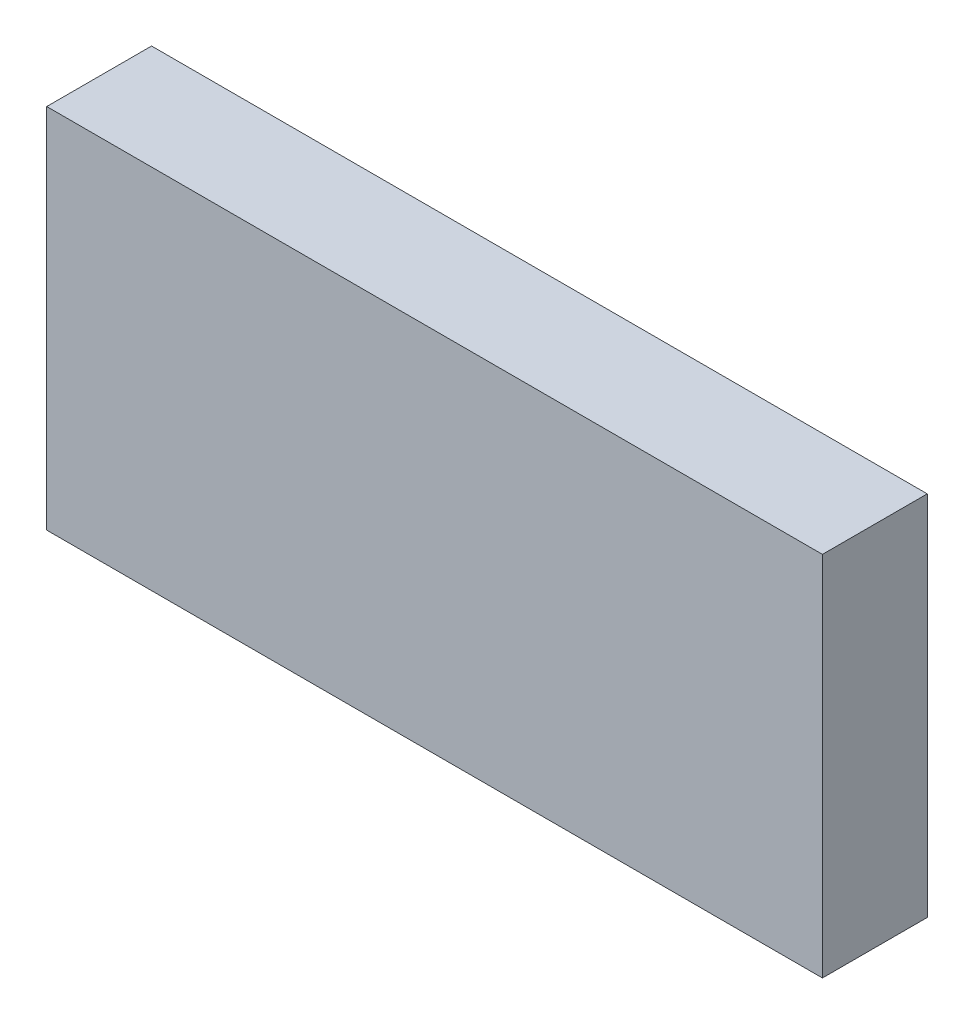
ISO-10303-21;
HEADER;
FILE_DESCRIPTION(('STEP AP214'),'2;1');
FILE_NAME('part.step','',(''),(''),'','','');
FILE_SCHEMA(('AUTOMOTIVE_DESIGN { 1 0 10303 214 1 1 1 1 }'));
ENDSEC;
DATA;
#1=APPLICATION_CONTEXT('core data for automotive mechanical design processes');
#2=APPLICATION_PROTOCOL_DEFINITION('international standard','automotive_design',2000,#1);
#3=PRODUCT_CONTEXT('',#1,'mechanical');
#4=PRODUCT('Part','Part','',(#3));
#5=PRODUCT_RELATED_PRODUCT_CATEGORY('part','',(#4));
#6=PRODUCT_DEFINITION_FORMATION('','',#4);
#7=PRODUCT_DEFINITION_CONTEXT('part definition',#1,'design');
#8=PRODUCT_DEFINITION('design','',#6,#7);
#9=PRODUCT_DEFINITION_SHAPE('','',#8);
#10=(LENGTH_UNIT() NAMED_UNIT(*) SI_UNIT(.MILLI.,.METRE.));
#11=(NAMED_UNIT(*) PLANE_ANGLE_UNIT() SI_UNIT($,.RADIAN.));
#12=(NAMED_UNIT(*) SI_UNIT($,.STERADIAN.) SOLID_ANGLE_UNIT());
#13=UNCERTAINTY_MEASURE_WITH_UNIT(LENGTH_MEASURE(1.E-05),#10,'distance_accuracy_value','');
#14=(GEOMETRIC_REPRESENTATION_CONTEXT(3) GLOBAL_UNCERTAINTY_ASSIGNED_CONTEXT((#13)) GLOBAL_UNIT_ASSIGNED_CONTEXT((#10,
#11,#12)) REPRESENTATION_CONTEXT('',''));
#15=CARTESIAN_POINT('',(0.,0.,0.));
#16=DIRECTION('',(0.,0.,1.));
#17=DIRECTION('',(1.,0.,0.));
#18=AXIS2_PLACEMENT_3D('',#15,#16,#17);
#19=CARTESIAN_POINT('',(718.383537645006,961.782671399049,1419.1892667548));
#20=DIRECTION('',(0.,0.,-1.));
#21=DIRECTION('',(-1.,0.,0.));
#22=AXIS2_PLACEMENT_3D('',#19,#20,#21);
#23=PLANE('',#22);
#24=DIRECTION('',(0.,-1.,0.));
#25=VECTOR('',#24,1.);
#26=CARTESIAN_POINT('',(703.583537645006,961.782671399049,1419.1892667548));
#27=LINE('',#26,#25);
#28=CARTESIAN_POINT('',(703.583537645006,961.782671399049,1419.1892667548));
#29=VERTEX_POINT('',#28);
#30=CARTESIAN_POINT('',(703.583537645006,954.782671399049,1419.1892667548));
#31=VERTEX_POINT('',#30);
#32=EDGE_CURVE('E113',#29,#31,#27,.T.);
#33=ORIENTED_EDGE('',*,*,#32,.T.);
#34=DIRECTION('',(-1.,0.,0.));
#35=VECTOR('',#34,1.);
#36=CARTESIAN_POINT('',(718.383537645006,954.782671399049,1419.1892667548));
#37=LINE('',#36,#35);
#38=CARTESIAN_POINT('',(718.383537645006,954.782671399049,1419.1892667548));
#39=VERTEX_POINT('',#38);
#40=EDGE_CURVE('E11',#39,#31,#37,.T.);
#41=ORIENTED_EDGE('',*,*,#40,.F.);
#42=DIRECTION('',(0.,-1.,0.));
#43=VECTOR('',#42,1.);
#44=CARTESIAN_POINT('',(718.383537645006,961.782671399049,1419.1892667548));
#45=LINE('',#44,#43);
#46=CARTESIAN_POINT('',(718.383537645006,961.782671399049,1419.1892667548));
#47=VERTEX_POINT('',#46);
#48=EDGE_CURVE('E97',#47,#39,#45,.T.);
#49=ORIENTED_EDGE('',*,*,#48,.F.);
#50=DIRECTION('',(-1.,0.,0.));
#51=VECTOR('',#50,1.);
#52=CARTESIAN_POINT('',(718.383537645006,961.782671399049,1419.1892667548));
#53=LINE('',#52,#51);
#54=EDGE_CURVE('E109',#47,#29,#53,.T.);
#55=ORIENTED_EDGE('',*,*,#54,.T.);
#56=EDGE_LOOP('',(#33,#41,#49,#55));
#57=FACE_BOUND('',#56,.T.);
#58=ADVANCED_FACE('F45',(#57),#23,.F.);
#59=CARTESIAN_POINT('',(718.383537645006,954.782671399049,1419.1892667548));
#60=DIRECTION('',(0.,1.,0.));
#61=DIRECTION('',(0.,0.,1.));
#62=AXIS2_PLACEMENT_3D('',#59,#60,#61);
#63=PLANE('',#62);
#64=DIRECTION('',(0.,0.,-1.));
#65=VECTOR('',#64,1.);
#66=CARTESIAN_POINT('',(703.583537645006,954.782671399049,1419.1892667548));
#67=LINE('',#66,#65);
#68=CARTESIAN_POINT('',(703.583537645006,954.782671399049,1417.1892667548));
#69=VERTEX_POINT('',#68);
#70=EDGE_CURVE('E102',#31,#69,#67,.T.);
#71=ORIENTED_EDGE('',*,*,#70,.T.);
#72=DIRECTION('',(-1.,0.,0.));
#73=VECTOR('',#72,1.);
#74=CARTESIAN_POINT('',(718.383537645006,954.782671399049,1417.1892667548));
#75=LINE('',#74,#73);
#76=CARTESIAN_POINT('',(718.383537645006,954.782671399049,1417.1892667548));
#77=VERTEX_POINT('',#76);
#78=EDGE_CURVE('E54',#77,#69,#75,.T.);
#79=ORIENTED_EDGE('',*,*,#78,.F.);
#80=DIRECTION('',(0.,0.,-1.));
#81=VECTOR('',#80,1.);
#82=CARTESIAN_POINT('',(718.383537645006,954.782671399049,1419.1892667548));
#83=LINE('',#82,#81);
#84=EDGE_CURVE('E92',#39,#77,#83,.T.);
#85=ORIENTED_EDGE('',*,*,#84,.F.);
#86=ORIENTED_EDGE('',*,*,#40,.T.);
#87=EDGE_LOOP('',(#71,#79,#85,#86));
#88=FACE_BOUND('',#87,.T.);
#89=ADVANCED_FACE('F101',(#88),#63,.F.);
#90=CARTESIAN_POINT('',(718.383537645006,961.782671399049,1417.1892667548));
#91=DIRECTION('',(0.,0.,1.));
#92=DIRECTION('',(1.,0.,0.));
#93=AXIS2_PLACEMENT_3D('',#90,#91,#92);
#94=PLANE('',#93);
#95=DIRECTION('',(0.,1.,0.));
#96=VECTOR('',#95,1.);
#97=CARTESIAN_POINT('',(703.583537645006,961.782671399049,1417.1892667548));
#98=LINE('',#97,#96);
#99=CARTESIAN_POINT('',(703.583537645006,961.782671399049,1417.1892667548));
#100=VERTEX_POINT('',#99);
#101=EDGE_CURVE('E79',#69,#100,#98,.T.);
#102=ORIENTED_EDGE('',*,*,#101,.T.);
#103=DIRECTION('',(-1.,0.,0.));
#104=VECTOR('',#103,1.);
#105=CARTESIAN_POINT('',(718.383537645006,961.782671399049,1417.1892667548));
#106=LINE('',#105,#104);
#107=CARTESIAN_POINT('',(718.383537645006,961.782671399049,1417.1892667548));
#108=VERTEX_POINT('',#107);
#109=EDGE_CURVE('E104',#108,#100,#106,.T.);
#110=ORIENTED_EDGE('',*,*,#109,.F.);
#111=DIRECTION('',(0.,1.,0.));
#112=VECTOR('',#111,1.);
#113=CARTESIAN_POINT('',(718.383537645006,961.782671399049,1417.1892667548));
#114=LINE('',#113,#112);
#115=EDGE_CURVE('E95',#77,#108,#114,.T.);
#116=ORIENTED_EDGE('',*,*,#115,.F.);
#117=ORIENTED_EDGE('',*,*,#78,.T.);
#118=EDGE_LOOP('',(#102,#110,#116,#117));
#119=FACE_BOUND('',#118,.T.);
#120=ADVANCED_FACE('F105',(#119),#94,.F.);
#121=CARTESIAN_POINT('',(718.383537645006,961.782671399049,1419.1892667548));
#122=DIRECTION('',(0.,-1.,0.));
#123=DIRECTION('',(0.,0.,-1.));
#124=AXIS2_PLACEMENT_3D('',#121,#122,#123);
#125=PLANE('',#124);
#126=DIRECTION('',(0.,0.,1.));
#127=VECTOR('',#126,1.);
#128=CARTESIAN_POINT('',(703.583537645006,961.782671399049,1419.1892667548));
#129=LINE('',#128,#127);
#130=EDGE_CURVE('E85',#100,#29,#129,.T.);
#131=ORIENTED_EDGE('',*,*,#130,.T.);
#132=ORIENTED_EDGE('',*,*,#54,.F.);
#133=DIRECTION('',(0.,0.,1.));
#134=VECTOR('',#133,1.);
#135=CARTESIAN_POINT('',(718.383537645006,961.782671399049,1419.1892667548));
#136=LINE('',#135,#134);
#137=EDGE_CURVE('E62',#108,#47,#136,.T.);
#138=ORIENTED_EDGE('',*,*,#137,.F.);
#139=ORIENTED_EDGE('',*,*,#109,.T.);
#140=EDGE_LOOP('',(#131,#132,#138,#139));
#141=FACE_BOUND('',#140,.T.);
#142=ADVANCED_FACE('F126',(#141),#125,.F.);
#143=CARTESIAN_POINT('',(718.383537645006,0.,0.));
#144=DIRECTION('',(1.,0.,0.));
#145=DIRECTION('',(0.,0.,-1.));
#146=AXIS2_PLACEMENT_3D('',#143,#144,#145);
#147=PLANE('',#146);
#148=ORIENTED_EDGE('',*,*,#48,.T.);
#149=ORIENTED_EDGE('',*,*,#84,.T.);
#150=ORIENTED_EDGE('',*,*,#115,.T.);
#151=ORIENTED_EDGE('',*,*,#137,.T.);
#152=EDGE_LOOP('',(#148,#149,#150,#151));
#153=FACE_BOUND('',#152,.T.);
#154=ADVANCED_FACE('F93',(#153),#147,.T.);
#155=CARTESIAN_POINT('',(703.583537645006,0.,0.));
#156=DIRECTION('',(1.,0.,0.));
#157=DIRECTION('',(0.,0.,-1.));
#158=AXIS2_PLACEMENT_3D('',#155,#156,#157);
#159=PLANE('',#158);
#160=ORIENTED_EDGE('',*,*,#32,.F.);
#161=ORIENTED_EDGE('',*,*,#130,.F.);
#162=ORIENTED_EDGE('',*,*,#101,.F.);
#163=ORIENTED_EDGE('',*,*,#70,.F.);
#164=EDGE_LOOP('',(#160,#161,#162,#163));
#165=FACE_BOUND('',#164,.T.);
#166=ADVANCED_FACE('F129',(#165),#159,.F.);
#167=CLOSED_SHELL('',(#58,#89,#120,#142,#154,#166));
#168=MANIFOLD_SOLID_BREP('B2',#167);
#169=ADVANCED_BREP_SHAPE_REPRESENTATION('',(#18,#168),#14);
#170=SHAPE_DEFINITION_REPRESENTATION(#9,#169);
ENDSEC;
END-ISO-10303-21;
